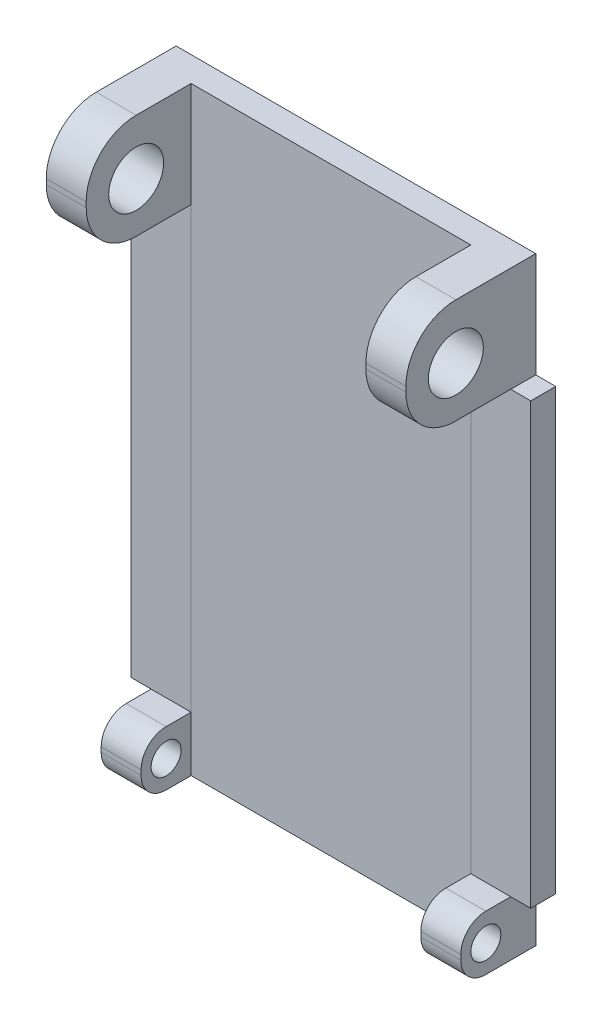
ISO-10303-21;
HEADER;
FILE_DESCRIPTION(('STEP AP214'),'2;1');
FILE_NAME('part.step','',(''),(''),'','','');
FILE_SCHEMA(('AUTOMOTIVE_DESIGN { 1 0 10303 214 1 1 1 1 }'));
ENDSEC;
DATA;
#1=APPLICATION_CONTEXT('core data for automotive mechanical design processes');
#2=APPLICATION_PROTOCOL_DEFINITION('international standard','automotive_design',2000,#1);
#3=PRODUCT_CONTEXT('',#1,'mechanical');
#4=PRODUCT('Part','Part','',(#3));
#5=PRODUCT_RELATED_PRODUCT_CATEGORY('part','',(#4));
#6=PRODUCT_DEFINITION_FORMATION('','',#4);
#7=PRODUCT_DEFINITION_CONTEXT('part definition',#1,'design');
#8=PRODUCT_DEFINITION('design','',#6,#7);
#9=PRODUCT_DEFINITION_SHAPE('','',#8);
#10=(LENGTH_UNIT() NAMED_UNIT(*) SI_UNIT(.MILLI.,.METRE.));
#11=(NAMED_UNIT(*) PLANE_ANGLE_UNIT() SI_UNIT($,.RADIAN.));
#12=(NAMED_UNIT(*) SI_UNIT($,.STERADIAN.) SOLID_ANGLE_UNIT());
#13=UNCERTAINTY_MEASURE_WITH_UNIT(LENGTH_MEASURE(1.E-05),#10,'distance_accuracy_value','');
#14=(GEOMETRIC_REPRESENTATION_CONTEXT(3) GLOBAL_UNCERTAINTY_ASSIGNED_CONTEXT((#13)) GLOBAL_UNIT_ASSIGNED_CONTEXT((#10,
#11,#12)) REPRESENTATION_CONTEXT('',''));
#15=CARTESIAN_POINT('',(0.,0.,0.));
#16=DIRECTION('',(0.,0.,1.));
#17=DIRECTION('',(1.,0.,0.));
#18=AXIS2_PLACEMENT_3D('',#15,#16,#17);
#19=CARTESIAN_POINT('',(-20.,-30.,13.));
#20=DIRECTION('',(1.,0.,0.));
#21=DIRECTION('',(0.,0.,-1.));
#22=AXIS2_PLACEMENT_3D('',#19,#20,#21);
#23=PLANE('',#22);
#24=DIRECTION('',(0.,0.,-1.));
#25=VECTOR('',#24,1.);
#26=CARTESIAN_POINT('',(-20.,-24.5,0.));
#27=LINE('',#26,#25);
#28=CARTESIAN_POINT('',(-20.,-24.5,2.50299537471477));
#29=VERTEX_POINT('',#28);
#30=CARTESIAN_POINT('',(-20.,-24.5,0.));
#31=VERTEX_POINT('',#30);
#32=EDGE_CURVE('E1002',#29,#31,#27,.T.);
#33=ORIENTED_EDGE('',*,*,#32,.F.);
#34=DIRECTION('',(0.,1.,0.));
#35=VECTOR('',#34,1.);
#36=CARTESIAN_POINT('',(-20.,-24.5,2.50299537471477));
#37=LINE('',#36,#35);
#38=CARTESIAN_POINT('',(-20.,19.49,2.50299537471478));
#39=VERTEX_POINT('',#38);
#40=EDGE_CURVE('E459',#29,#39,#37,.T.);
#41=ORIENTED_EDGE('',*,*,#40,.T.);
#42=DIRECTION('',(0.,0.,1.));
#43=VECTOR('',#42,1.);
#44=CARTESIAN_POINT('',(-20.,19.49,10.));
#45=LINE('',#44,#43);
#46=CARTESIAN_POINT('',(-20.,19.49,0.));
#47=VERTEX_POINT('',#46);
#48=EDGE_CURVE('E596',#47,#39,#45,.T.);
#49=ORIENTED_EDGE('',*,*,#48,.F.);
#50=DIRECTION('',(0.,-1.,0.));
#51=VECTOR('',#50,1.);
#52=CARTESIAN_POINT('',(-20.,-30.,0.));
#53=LINE('',#52,#51);
#54=EDGE_CURVE('E477',#47,#31,#53,.T.);
#55=ORIENTED_EDGE('',*,*,#54,.T.);
#56=EDGE_LOOP('',(#33,#41,#49,#55));
#57=FACE_BOUND('',#56,.T.);
#58=ADVANCED_FACE('F37',(#57),#23,.F.);
#59=CARTESIAN_POINT('',(0.,0.,13.));
#60=DIRECTION('',(0.,0.,1.));
#61=DIRECTION('',(1.,0.,0.));
#62=AXIS2_PLACEMENT_3D('',#59,#60,#61);
#63=PLANE('',#62);
#64=DIRECTION('',(0.,1.,0.));
#65=VECTOR('',#64,1.);
#66=CARTESIAN_POINT('',(18.,19.49,13.));
#67=LINE('',#66,#65);
#68=CARTESIAN_POINT('',(18.,24.49,13.));
#69=VERTEX_POINT('',#68);
#70=CARTESIAN_POINT('',(18.,25.,13.));
#71=VERTEX_POINT('',#70);
#72=EDGE_CURVE('E519',#69,#71,#67,.T.);
#73=ORIENTED_EDGE('',*,*,#72,.T.);
#74=DIRECTION('',(-1.,0.,0.));
#75=VECTOR('',#74,1.);
#76=CARTESIAN_POINT('',(14.,25.,13.));
#77=LINE('',#76,#75);
#78=CARTESIAN_POINT('',(14.,25.,13.));
#79=VERTEX_POINT('',#78);
#80=EDGE_CURVE('E313',#71,#79,#77,.T.);
#81=ORIENTED_EDGE('',*,*,#80,.T.);
#82=DIRECTION('',(0.,1.,0.));
#83=VECTOR('',#82,1.);
#84=CARTESIAN_POINT('',(14.,0.,13.));
#85=LINE('',#84,#83);
#86=CARTESIAN_POINT('',(14.,24.49,13.));
#87=VERTEX_POINT('',#86);
#88=EDGE_CURVE('E448',#87,#79,#85,.T.);
#89=ORIENTED_EDGE('',*,*,#88,.F.);
#90=DIRECTION('',(1.,0.,0.));
#91=VECTOR('',#90,1.);
#92=CARTESIAN_POINT('',(20.,24.49,13.));
#93=LINE('',#92,#91);
#94=EDGE_CURVE('E310',#87,#69,#93,.T.);
#95=ORIENTED_EDGE('',*,*,#94,.T.);
#96=EDGE_LOOP('',(#73,#81,#89,#95));
#97=FACE_BOUND('',#96,.T.);
#98=ADVANCED_FACE('F553',(#97),#63,.T.);
#99=CARTESIAN_POINT('',(-20.,19.49,13.));
#100=DIRECTION('',(0.,1.,0.));
#101=DIRECTION('',(0.,0.,1.));
#102=AXIS2_PLACEMENT_3D('',#99,#100,#101);
#103=PLANE('',#102);
#104=DIRECTION('',(1.,0.,0.));
#105=VECTOR('',#104,1.);
#106=CARTESIAN_POINT('',(-20.,19.49,7.50299537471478));
#107=LINE('',#106,#105);
#108=CARTESIAN_POINT('',(14.,19.49,7.50299537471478));
#109=VERTEX_POINT('',#108);
#110=CARTESIAN_POINT('',(18.,19.49,7.50299537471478));
#111=VERTEX_POINT('',#110);
#112=EDGE_CURVE('E466',#109,#111,#107,.T.);
#113=ORIENTED_EDGE('',*,*,#112,.T.);
#114=DIRECTION('',(0.,0.,1.));
#115=VECTOR('',#114,1.);
#116=CARTESIAN_POINT('',(18.,19.49,0.));
#117=LINE('',#116,#115);
#118=CARTESIAN_POINT('',(18.,19.49,8.));
#119=VERTEX_POINT('',#118);
#120=EDGE_CURVE('E515',#111,#119,#117,.T.);
#121=ORIENTED_EDGE('',*,*,#120,.T.);
#122=DIRECTION('',(1.,0.,0.));
#123=VECTOR('',#122,1.);
#124=CARTESIAN_POINT('',(14.,19.49,8.));
#125=LINE('',#124,#123);
#126=CARTESIAN_POINT('',(14.,19.49,8.));
#127=VERTEX_POINT('',#126);
#128=EDGE_CURVE('E323',#119,#127,#125,.F.);
#129=ORIENTED_EDGE('',*,*,#128,.T.);
#130=DIRECTION('',(0.,0.,-1.));
#131=VECTOR('',#130,1.);
#132=CARTESIAN_POINT('',(14.,19.49,13.));
#133=LINE('',#132,#131);
#134=EDGE_CURVE('E446',#127,#109,#133,.T.);
#135=ORIENTED_EDGE('',*,*,#134,.T.);
#136=EDGE_LOOP('',(#113,#121,#129,#135));
#137=FACE_BOUND('',#136,.T.);
#138=ADVANCED_FACE('F544',(#137),#103,.F.);
#139=CARTESIAN_POINT('',(-20.,-30.,7.50299537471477));
#140=DIRECTION('',(0.,0.,-1.));
#141=DIRECTION('',(0.,1.,0.));
#142=AXIS2_PLACEMENT_3D('',#139,#140,#141);
#143=PLANE('',#142);
#144=DIRECTION('',(1.,0.,0.));
#145=VECTOR('',#144,1.);
#146=CARTESIAN_POINT('',(-20.,-27.5,7.50299537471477));
#147=LINE('',#146,#145);
#148=CARTESIAN_POINT('',(14.,-27.5,7.50299537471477));
#149=VERTEX_POINT('',#148);
#150=CARTESIAN_POINT('',(18.,-27.5,7.50299537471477));
#151=VERTEX_POINT('',#150);
#152=EDGE_CURVE('E339',#149,#151,#147,.T.);
#153=ORIENTED_EDGE('',*,*,#152,.T.);
#154=DIRECTION('',(0.,1.,0.));
#155=VECTOR('',#154,1.);
#156=CARTESIAN_POINT('',(18.,-30.,7.50299537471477));
#157=LINE('',#156,#155);
#158=CARTESIAN_POINT('',(18.,-27.,7.50299537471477));
#159=VERTEX_POINT('',#158);
#160=EDGE_CURVE('E350',#151,#159,#157,.T.);
#161=ORIENTED_EDGE('',*,*,#160,.T.);
#162=DIRECTION('',(1.,0.,0.));
#163=VECTOR('',#162,1.);
#164=CARTESIAN_POINT('',(-20.,-27.,7.50299537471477));
#165=LINE('',#164,#163);
#166=CARTESIAN_POINT('',(14.,-27.,7.50299537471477));
#167=VERTEX_POINT('',#166);
#168=EDGE_CURVE('E337',#159,#167,#165,.F.);
#169=ORIENTED_EDGE('',*,*,#168,.T.);
#170=DIRECTION('',(0.,-1.,0.));
#171=VECTOR('',#170,1.);
#172=CARTESIAN_POINT('',(14.,-30.,7.50299537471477));
#173=LINE('',#172,#171);
#174=EDGE_CURVE('E370',#167,#149,#173,.T.);
#175=ORIENTED_EDGE('',*,*,#174,.T.);
#176=EDGE_LOOP('',(#153,#161,#169,#175));
#177=FACE_BOUND('',#176,.T.);
#178=ADVANCED_FACE('F356',(#177),#143,.F.);
#179=CARTESIAN_POINT('',(-20.,-27.27,5.));
#180=DIRECTION('',(1.,0.,0.));
#181=DIRECTION('',(0.,0.,-1.));
#182=AXIS2_PLACEMENT_3D('',#179,#180,#181);
#183=CYLINDRICAL_SURFACE('',#182,1.5);
#184=CARTESIAN_POINT('',(18.,-27.27,5.));
#185=DIRECTION('',(-1.,0.,0.));
#186=DIRECTION('',(0.,-1.,0.));
#187=AXIS2_PLACEMENT_3D('',#184,#185,#186);
#188=CIRCLE('',#187,1.5);
#189=CARTESIAN_POINT('',(18.,-28.77,5.));
#190=VERTEX_POINT('',#189);
#191=EDGE_CURVE('E593',#190,#190,#188,.F.);
#192=ORIENTED_EDGE('',*,*,#191,.T.);
#193=EDGE_LOOP('',(#192));
#194=FACE_BOUND('',#193,.T.);
#195=CARTESIAN_POINT('',(14.,-27.27,5.));
#196=DIRECTION('',(1.,0.,0.));
#197=DIRECTION('',(0.,0.,-1.));
#198=AXIS2_PLACEMENT_3D('',#195,#196,#197);
#199=CIRCLE('',#198,1.5);
#200=CARTESIAN_POINT('',(14.,-27.27,3.5));
#201=VERTEX_POINT('',#200);
#202=EDGE_CURVE('E452',#201,#201,#199,.F.);
#203=ORIENTED_EDGE('',*,*,#202,.T.);
#204=EDGE_LOOP('',(#203));
#205=FACE_BOUND('',#204,.T.);
#206=ADVANCED_FACE('F735',(#194,#205),#183,.F.);
#207=CARTESIAN_POINT('',(-20.,-24.5,7.50299537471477));
#208=DIRECTION('',(0.,0.,1.));
#209=DIRECTION('',(0.,-1.,0.));
#210=AXIS2_PLACEMENT_3D('',#207,#208,#209);
#211=PLANE('',#210);
#212=DIRECTION('',(1.,0.,0.));
#213=VECTOR('',#212,1.);
#214=CARTESIAN_POINT('',(-20.,19.5,7.50299537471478));
#215=LINE('',#214,#213);
#216=CARTESIAN_POINT('',(14.,19.5,7.50299537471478));
#217=VERTEX_POINT('',#216);
#218=CARTESIAN_POINT('',(18.,19.5,7.50299537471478));
#219=VERTEX_POINT('',#218);
#220=EDGE_CURVE('E467',#217,#219,#215,.T.);
#221=ORIENTED_EDGE('',*,*,#220,.T.);
#222=DIRECTION('',(0.,-1.,0.));
#223=VECTOR('',#222,1.);
#224=CARTESIAN_POINT('',(18.,-24.5,7.50299537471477));
#225=LINE('',#224,#223);
#226=EDGE_CURVE('E385',#219,#111,#225,.T.);
#227=ORIENTED_EDGE('',*,*,#226,.T.);
#228=ORIENTED_EDGE('',*,*,#112,.F.);
#229=DIRECTION('',(0.,1.,0.));
#230=VECTOR('',#229,1.);
#231=CARTESIAN_POINT('',(14.,-24.5,7.50299537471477));
#232=LINE('',#231,#230);
#233=EDGE_CURVE('E442',#109,#217,#232,.T.);
#234=ORIENTED_EDGE('',*,*,#233,.T.);
#235=EDGE_LOOP('',(#221,#227,#228,#234));
#236=FACE_BOUND('',#235,.T.);
#237=ADVANCED_FACE('F541',(#236),#211,.F.);
#238=CARTESIAN_POINT('',(-20.,19.5,7.50299537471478));
#239=DIRECTION('',(0.,1.,0.));
#240=DIRECTION('',(0.,0.,1.));
#241=AXIS2_PLACEMENT_3D('',#238,#239,#240);
#242=PLANE('',#241);
#243=DIRECTION('',(1.,0.,0.));
#244=VECTOR('',#243,1.);
#245=CARTESIAN_POINT('',(-20.,19.5,2.50299537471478));
#246=LINE('',#245,#244);
#247=CARTESIAN_POINT('',(14.,19.5,2.50299537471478));
#248=VERTEX_POINT('',#247);
#249=CARTESIAN_POINT('',(18.,19.5,2.50299537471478));
#250=VERTEX_POINT('',#249);
#251=EDGE_CURVE('E470',#248,#250,#246,.T.);
#252=ORIENTED_EDGE('',*,*,#251,.T.);
#253=DIRECTION('',(0.,0.,1.));
#254=VECTOR('',#253,1.);
#255=CARTESIAN_POINT('',(18.,19.5,7.50299537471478));
#256=LINE('',#255,#254);
#257=EDGE_CURVE('E392',#250,#219,#256,.T.);
#258=ORIENTED_EDGE('',*,*,#257,.T.);
#259=ORIENTED_EDGE('',*,*,#220,.F.);
#260=DIRECTION('',(0.,0.,-1.));
#261=VECTOR('',#260,1.);
#262=CARTESIAN_POINT('',(14.,19.5,7.50299537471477));
#263=LINE('',#262,#261);
#264=EDGE_CURVE('E439',#217,#248,#263,.T.);
#265=ORIENTED_EDGE('',*,*,#264,.T.);
#266=EDGE_LOOP('',(#252,#258,#259,#265));
#267=FACE_BOUND('',#266,.T.);
#268=ADVANCED_FACE('F537',(#267),#242,.F.);
#269=CARTESIAN_POINT('',(-20.,-24.5,2.50299537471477));
#270=DIRECTION('',(0.,0.,-1.));
#271=DIRECTION('',(0.,1.,0.));
#272=AXIS2_PLACEMENT_3D('',#269,#270,#271);
#273=PLANE('',#272);
#274=DIRECTION('',(-1.,0.,0.));
#275=VECTOR('',#274,1.);
#276=CARTESIAN_POINT('',(-20.0000000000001,19.4899999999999,2.50299537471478));
#277=LINE('',#276,#275);
#278=CARTESIAN_POINT('',(20.,19.49,2.50299537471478));
#279=VERTEX_POINT('',#278);
#280=CARTESIAN_POINT('',(18.,19.49,2.50299537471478));
#281=VERTEX_POINT('',#280);
#282=EDGE_CURVE('E522',#279,#281,#277,.T.);
#283=ORIENTED_EDGE('',*,*,#282,.T.);
#284=DIRECTION('',(0.,1.,0.));
#285=VECTOR('',#284,1.);
#286=CARTESIAN_POINT('',(18.,-24.5,2.50299537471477));
#287=LINE('',#286,#285);
#288=EDGE_CURVE('E399',#281,#250,#287,.T.);
#289=ORIENTED_EDGE('',*,*,#288,.T.);
#290=ORIENTED_EDGE('',*,*,#251,.F.);
#291=DIRECTION('',(0.,-1.,0.));
#292=VECTOR('',#291,1.);
#293=CARTESIAN_POINT('',(14.,-24.5,2.50299537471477));
#294=LINE('',#293,#292);
#295=CARTESIAN_POINT('',(14.,-24.5,2.50299537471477));
#296=VERTEX_POINT('',#295);
#297=EDGE_CURVE('E437',#248,#296,#294,.T.);
#298=ORIENTED_EDGE('',*,*,#297,.T.);
#299=DIRECTION('',(1.,0.,0.));
#300=VECTOR('',#299,1.);
#301=CARTESIAN_POINT('',(-20.,-24.5,2.50299537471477));
#302=LINE('',#301,#300);
#303=CARTESIAN_POINT('',(18.,-24.5,2.50299537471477));
#304=VERTEX_POINT('',#303);
#305=EDGE_CURVE('E375',#296,#304,#302,.T.);
#306=ORIENTED_EDGE('',*,*,#305,.T.);
#307=DIRECTION('',(1.,0.,0.));
#308=VECTOR('',#307,1.);
#309=CARTESIAN_POINT('',(-20.,-24.5,2.50299537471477));
#310=LINE('',#309,#308);
#311=CARTESIAN_POINT('',(20.,-24.5,2.50299537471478));
#312=VERTEX_POINT('',#311);
#313=EDGE_CURVE('E361',#304,#312,#310,.T.);
#314=ORIENTED_EDGE('',*,*,#313,.T.);
#315=DIRECTION('',(0.,1.,0.));
#316=VECTOR('',#315,1.);
#317=CARTESIAN_POINT('',(20.,-24.5,2.50299537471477));
#318=LINE('',#317,#316);
#319=EDGE_CURVE('E458',#312,#279,#318,.T.);
#320=ORIENTED_EDGE('',*,*,#319,.T.);
#321=EDGE_LOOP('',(#283,#289,#290,#298,#306,#314,#320));
#322=FACE_BOUND('',#321,.T.);
#323=ADVANCED_FACE('F534',(#322),#273,.F.);
#324=CARTESIAN_POINT('',(-20.,-24.5,7.50299537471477));
#325=DIRECTION('',(0.,-1.,0.));
#326=DIRECTION('',(0.,0.,-1.));
#327=AXIS2_PLACEMENT_3D('',#324,#325,#326);
#328=PLANE('',#327);
#329=DIRECTION('',(1.,0.,0.));
#330=VECTOR('',#329,1.);
#331=CARTESIAN_POINT('',(-20.,-24.5,5.00299537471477));
#332=LINE('',#331,#330);
#333=CARTESIAN_POINT('',(14.,-24.5,5.00299537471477));
#334=VERTEX_POINT('',#333);
#335=CARTESIAN_POINT('',(18.,-24.5,5.00299537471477));
#336=VERTEX_POINT('',#335);
#337=EDGE_CURVE('E342',#334,#336,#332,.T.);
#338=ORIENTED_EDGE('',*,*,#337,.T.);
#339=DIRECTION('',(0.,0.,-1.));
#340=VECTOR('',#339,1.);
#341=CARTESIAN_POINT('',(18.,-24.5,0.));
#342=LINE('',#341,#340);
#343=EDGE_CURVE('E59',#336,#304,#342,.T.);
#344=ORIENTED_EDGE('',*,*,#343,.T.);
#345=ORIENTED_EDGE('',*,*,#305,.F.);
#346=DIRECTION('',(0.,0.,1.));
#347=VECTOR('',#346,1.);
#348=CARTESIAN_POINT('',(14.,-24.5,7.50299537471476));
#349=LINE('',#348,#347);
#350=EDGE_CURVE('E294',#296,#334,#349,.T.);
#351=ORIENTED_EDGE('',*,*,#350,.T.);
#352=EDGE_LOOP('',(#338,#344,#345,#351));
#353=FACE_BOUND('',#352,.T.);
#354=ADVANCED_FACE('F373',(#353),#328,.F.);
#355=CARTESIAN_POINT('',(20.,-30.,13.));
#356=DIRECTION('',(0.,1.,0.));
#357=DIRECTION('',(-1.,0.,0.));
#358=AXIS2_PLACEMENT_3D('',#355,#356,#357);
#359=PLANE('',#358);
#360=DIRECTION('',(1.,0.,0.));
#361=VECTOR('',#360,1.);
#362=CARTESIAN_POINT('',(20.,-30.,5.00299537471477));
#363=LINE('',#362,#361);
#364=CARTESIAN_POINT('',(-14.,-30.,5.00299537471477));
#365=VERTEX_POINT('',#364);
#366=CARTESIAN_POINT('',(-18.,-30.,5.00299537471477));
#367=VERTEX_POINT('',#366);
#368=EDGE_CURVE('E334',#365,#367,#363,.F.);
#369=ORIENTED_EDGE('',*,*,#368,.T.);
#370=DIRECTION('',(0.,0.,1.));
#371=VECTOR('',#370,1.);
#372=CARTESIAN_POINT('',(-18.,-30.,0.));
#373=LINE('',#372,#371);
#374=CARTESIAN_POINT('',(-18.,-30.,0.));
#375=VERTEX_POINT('',#374);
#376=EDGE_CURVE('E51',#375,#367,#373,.T.);
#377=ORIENTED_EDGE('',*,*,#376,.F.);
#378=DIRECTION('',(1.,0.,0.));
#379=VECTOR('',#378,1.);
#380=CARTESIAN_POINT('',(20.,-30.,0.));
#381=LINE('',#380,#379);
#382=CARTESIAN_POINT('',(18.,-30.,0.));
#383=VERTEX_POINT('',#382);
#384=EDGE_CURVE('E480',#375,#383,#381,.T.);
#385=ORIENTED_EDGE('',*,*,#384,.T.);
#386=DIRECTION('',(0.,0.,-1.));
#387=VECTOR('',#386,1.);
#388=CARTESIAN_POINT('',(18.,-30.,0.));
#389=LINE('',#388,#387);
#390=CARTESIAN_POINT('',(18.,-30.,5.00299537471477));
#391=VERTEX_POINT('',#390);
#392=EDGE_CURVE('E582',#391,#383,#389,.T.);
#393=ORIENTED_EDGE('',*,*,#392,.F.);
#394=DIRECTION('',(1.,0.,0.));
#395=VECTOR('',#394,1.);
#396=CARTESIAN_POINT('',(20.,-30.,5.00299537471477));
#397=LINE('',#396,#395);
#398=CARTESIAN_POINT('',(14.,-30.,5.00299537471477));
#399=VERTEX_POINT('',#398);
#400=EDGE_CURVE('E332',#391,#399,#397,.F.);
#401=ORIENTED_EDGE('',*,*,#400,.T.);
#402=DIRECTION('',(0.,0.,-1.));
#403=VECTOR('',#402,1.);
#404=CARTESIAN_POINT('',(14.,-30.,13.));
#405=LINE('',#404,#403);
#406=CARTESIAN_POINT('',(14.,-30.,2.5));
#407=VERTEX_POINT('',#406);
#408=EDGE_CURVE('E450',#399,#407,#405,.T.);
#409=ORIENTED_EDGE('',*,*,#408,.T.);
#410=DIRECTION('',(-1.,0.,0.));
#411=VECTOR('',#410,1.);
#412=CARTESIAN_POINT('',(20.,-30.,2.5));
#413=LINE('',#412,#411);
#414=CARTESIAN_POINT('',(-14.,-30.,2.5));
#415=VERTEX_POINT('',#414);
#416=EDGE_CURVE('E455',#407,#415,#413,.T.);
#417=ORIENTED_EDGE('',*,*,#416,.T.);
#418=DIRECTION('',(0.,0.,1.));
#419=VECTOR('',#418,1.);
#420=CARTESIAN_POINT('',(-14.,-30.,13.));
#421=LINE('',#420,#419);
#422=EDGE_CURVE('E431',#415,#365,#421,.T.);
#423=ORIENTED_EDGE('',*,*,#422,.T.);
#424=EDGE_LOOP('',(#369,#377,#385,#393,#401,#409,#417,#423));
#425=FACE_BOUND('',#424,.T.);
#426=ADVANCED_FACE('F648',(#425),#359,.F.);
#427=CARTESIAN_POINT('',(20.,-30.,13.));
#428=DIRECTION('',(-1.,0.,0.));
#429=DIRECTION('',(0.,0.,1.));
#430=AXIS2_PLACEMENT_3D('',#427,#428,#429);
#431=PLANE('',#430);
#432=ORIENTED_EDGE('',*,*,#319,.F.);
#433=DIRECTION('',(0.,0.,1.));
#434=VECTOR('',#433,1.);
#435=CARTESIAN_POINT('',(20.,-24.5,0.));
#436=LINE('',#435,#434);
#437=CARTESIAN_POINT('',(20.,-24.5,0.));
#438=VERTEX_POINT('',#437);
#439=EDGE_CURVE('E576',#438,#312,#436,.T.);
#440=ORIENTED_EDGE('',*,*,#439,.F.);
#441=DIRECTION('',(0.,1.,0.));
#442=VECTOR('',#441,1.);
#443=CARTESIAN_POINT('',(20.,-30.,0.));
#444=LINE('',#443,#442);
#445=CARTESIAN_POINT('',(20.,19.49,0.));
#446=VERTEX_POINT('',#445);
#447=EDGE_CURVE('E482',#438,#446,#444,.T.);
#448=ORIENTED_EDGE('',*,*,#447,.T.);
#449=DIRECTION('',(0.,0.,-1.));
#450=VECTOR('',#449,1.);
#451=CARTESIAN_POINT('',(20.,19.49,0.));
#452=LINE('',#451,#450);
#453=EDGE_CURVE('E503',#279,#446,#452,.T.);
#454=ORIENTED_EDGE('',*,*,#453,.F.);
#455=EDGE_LOOP('',(#432,#440,#448,#454));
#456=FACE_BOUND('',#455,.T.);
#457=ADVANCED_FACE('F575',(#456),#431,.F.);
#458=CARTESIAN_POINT('',(20.,30.,13.));
#459=DIRECTION('',(0.,-1.,0.));
#460=DIRECTION('',(1.,0.,0.));
#461=AXIS2_PLACEMENT_3D('',#458,#459,#460);
#462=PLANE('',#461);
#463=DIRECTION('',(-1.,0.,0.));
#464=VECTOR('',#463,1.);
#465=CARTESIAN_POINT('',(20.,30.,0.));
#466=LINE('',#465,#464);
#467=CARTESIAN_POINT('',(18.,30.,0.));
#468=VERTEX_POINT('',#467);
#469=CARTESIAN_POINT('',(-18.,30.,0.));
#470=VERTEX_POINT('',#469);
#471=EDGE_CURVE('E379',#468,#470,#466,.T.);
#472=ORIENTED_EDGE('',*,*,#471,.T.);
#473=DIRECTION('',(0.,0.,-1.));
#474=VECTOR('',#473,1.);
#475=CARTESIAN_POINT('',(-18.,30.,9.99999999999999));
#476=LINE('',#475,#474);
#477=CARTESIAN_POINT('',(-18.,30.,8.));
#478=VERTEX_POINT('',#477);
#479=EDGE_CURVE('E488',#478,#470,#476,.T.);
#480=ORIENTED_EDGE('',*,*,#479,.F.);
#481=DIRECTION('',(-1.,0.,0.));
#482=VECTOR('',#481,1.);
#483=CARTESIAN_POINT('',(-14.,30.,8.));
#484=LINE('',#483,#482);
#485=CARTESIAN_POINT('',(-14.,30.,8.));
#486=VERTEX_POINT('',#485);
#487=EDGE_CURVE('E270',#478,#486,#484,.F.);
#488=ORIENTED_EDGE('',*,*,#487,.T.);
#489=DIRECTION('',(0.,0.,1.));
#490=VECTOR('',#489,1.);
#491=CARTESIAN_POINT('',(-14.,30.,13.2));
#492=LINE('',#491,#490);
#493=CARTESIAN_POINT('',(-14.,30.,2.5));
#494=VERTEX_POINT('',#493);
#495=EDGE_CURVE('E407',#494,#486,#492,.T.);
#496=ORIENTED_EDGE('',*,*,#495,.F.);
#497=DIRECTION('',(-1.,0.,0.));
#498=VECTOR('',#497,1.);
#499=CARTESIAN_POINT('',(-14.,30.,2.5));
#500=LINE('',#499,#498);
#501=CARTESIAN_POINT('',(14.,30.,2.5));
#502=VERTEX_POINT('',#501);
#503=EDGE_CURVE('E404',#502,#494,#500,.T.);
#504=ORIENTED_EDGE('',*,*,#503,.F.);
#505=DIRECTION('',(0.,0.,-1.));
#506=VECTOR('',#505,1.);
#507=CARTESIAN_POINT('',(14.,30.,2.5));
#508=LINE('',#507,#506);
#509=CARTESIAN_POINT('',(14.,30.,8.));
#510=VERTEX_POINT('',#509);
#511=EDGE_CURVE('E389',#510,#502,#508,.T.);
#512=ORIENTED_EDGE('',*,*,#511,.F.);
#513=DIRECTION('',(-1.,0.,0.));
#514=VECTOR('',#513,1.);
#515=CARTESIAN_POINT('',(20.,30.,8.));
#516=LINE('',#515,#514);
#517=CARTESIAN_POINT('',(18.,30.,8.));
#518=VERTEX_POINT('',#517);
#519=EDGE_CURVE('E289',#510,#518,#516,.F.);
#520=ORIENTED_EDGE('',*,*,#519,.T.);
#521=DIRECTION('',(0.,0.,1.));
#522=VECTOR('',#521,1.);
#523=CARTESIAN_POINT('',(18.,30.,0.));
#524=LINE('',#523,#522);
#525=EDGE_CURVE('E489',#468,#518,#524,.T.);
#526=ORIENTED_EDGE('',*,*,#525,.F.);
#527=EDGE_LOOP('',(#472,#480,#488,#496,#504,#512,#520,#526));
#528=FACE_BOUND('',#527,.T.);
#529=ADVANCED_FACE('F487',(#528),#462,.F.);
#530=DIRECTION('',(0.,-1.,0.));
#531=VECTOR('',#530,1.);
#532=CARTESIAN_POINT('',(-18.,19.9074243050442,13.));
#533=LINE('',#532,#531);
#534=CARTESIAN_POINT('',(-18.,25.,13.));
#535=VERTEX_POINT('',#534);
#536=CARTESIAN_POINT('',(-18.,24.49,13.));
#537=VERTEX_POINT('',#536);
#538=EDGE_CURVE('E277',#535,#537,#533,.T.);
#539=ORIENTED_EDGE('',*,*,#538,.T.);
#540=DIRECTION('',(1.,0.,0.));
#541=VECTOR('',#540,1.);
#542=CARTESIAN_POINT('',(-14.,24.49,13.));
#543=LINE('',#542,#541);
#544=CARTESIAN_POINT('',(-14.,24.49,13.));
#545=VERTEX_POINT('',#544);
#546=EDGE_CURVE('E290',#537,#545,#543,.T.);
#547=ORIENTED_EDGE('',*,*,#546,.T.);
#548=DIRECTION('',(0.,-1.,0.));
#549=VECTOR('',#548,1.);
#550=CARTESIAN_POINT('',(-14.,0.,13.));
#551=LINE('',#550,#549);
#552=CARTESIAN_POINT('',(-14.,25.,13.));
#553=VERTEX_POINT('',#552);
#554=EDGE_CURVE('E288',#553,#545,#551,.T.);
#555=ORIENTED_EDGE('',*,*,#554,.F.);
#556=DIRECTION('',(-1.,0.,0.));
#557=VECTOR('',#556,1.);
#558=CARTESIAN_POINT('',(-20.,25.,13.));
#559=LINE('',#558,#557);
#560=EDGE_CURVE('E269',#553,#535,#559,.T.);
#561=ORIENTED_EDGE('',*,*,#560,.T.);
#562=EDGE_LOOP('',(#539,#547,#555,#561));
#563=FACE_BOUND('',#562,.T.);
#564=ADVANCED_FACE('F286',(#563),#63,.T.);
#565=CARTESIAN_POINT('',(0.,0.,0.));
#566=DIRECTION('',(0.,0.,1.));
#567=DIRECTION('',(1.,0.,0.));
#568=AXIS2_PLACEMENT_3D('',#565,#566,#567);
#569=PLANE('',#568);
#570=ORIENTED_EDGE('',*,*,#384,.F.);
#571=DIRECTION('',(0.,-1.,0.));
#572=VECTOR('',#571,1.);
#573=CARTESIAN_POINT('',(-18.,-24.5,0.));
#574=LINE('',#573,#572);
#575=CARTESIAN_POINT('',(-18.,-24.5,0.));
#576=VERTEX_POINT('',#575);
#577=EDGE_CURVE('E651',#576,#375,#574,.T.);
#578=ORIENTED_EDGE('',*,*,#577,.F.);
#579=DIRECTION('',(1.,0.,0.));
#580=VECTOR('',#579,1.);
#581=CARTESIAN_POINT('',(-20.,-24.5,0.));
#582=LINE('',#581,#580);
#583=EDGE_CURVE('E1004',#31,#576,#582,.T.);
#584=ORIENTED_EDGE('',*,*,#583,.F.);
#585=ORIENTED_EDGE('',*,*,#54,.F.);
#586=DIRECTION('',(1.,0.,0.));
#587=VECTOR('',#586,1.);
#588=CARTESIAN_POINT('',(0.,19.49,0.));
#589=LINE('',#588,#587);
#590=CARTESIAN_POINT('',(-18.,19.49,0.));
#591=VERTEX_POINT('',#590);
#592=EDGE_CURVE('E274',#47,#591,#589,.T.);
#593=ORIENTED_EDGE('',*,*,#592,.T.);
#594=DIRECTION('',(0.,1.,0.));
#595=VECTOR('',#594,1.);
#596=CARTESIAN_POINT('',(-18.,0.,0.));
#597=LINE('',#596,#595);
#598=EDGE_CURVE('E498',#591,#470,#597,.T.);
#599=ORIENTED_EDGE('',*,*,#598,.T.);
#600=ORIENTED_EDGE('',*,*,#471,.F.);
#601=DIRECTION('',(0.,1.,0.));
#602=VECTOR('',#601,1.);
#603=CARTESIAN_POINT('',(18.,19.49,0.));
#604=LINE('',#603,#602);
#605=CARTESIAN_POINT('',(18.,19.49,0.));
#606=VERTEX_POINT('',#605);
#607=EDGE_CURVE('E496',#606,#468,#604,.T.);
#608=ORIENTED_EDGE('',*,*,#607,.F.);
#609=DIRECTION('',(-1.,0.,0.));
#610=VECTOR('',#609,1.);
#611=CARTESIAN_POINT('',(20.,19.49,0.));
#612=LINE('',#611,#610);
#613=EDGE_CURVE('E512',#446,#606,#612,.T.);
#614=ORIENTED_EDGE('',*,*,#613,.F.);
#615=ORIENTED_EDGE('',*,*,#447,.F.);
#616=DIRECTION('',(1.,0.,0.));
#617=VECTOR('',#616,1.);
#618=CARTESIAN_POINT('',(20.,-24.5,0.));
#619=LINE('',#618,#617);
#620=CARTESIAN_POINT('',(18.,-24.5,0.));
#621=VERTEX_POINT('',#620);
#622=EDGE_CURVE('E571',#621,#438,#619,.T.);
#623=ORIENTED_EDGE('',*,*,#622,.F.);
#624=DIRECTION('',(0.,-1.,0.));
#625=VECTOR('',#624,1.);
#626=CARTESIAN_POINT('',(18.,-24.5,0.));
#627=LINE('',#626,#625);
#628=EDGE_CURVE('E589',#621,#383,#627,.T.);
#629=ORIENTED_EDGE('',*,*,#628,.T.);
#630=EDGE_LOOP('',(#570,#578,#584,#585,#593,#599,#600,#608,#614,#615,#623,#629));
#631=FACE_BOUND('',#630,.T.);
#632=ADVANCED_FACE('F494',(#631),#569,.F.);
#633=DIRECTION('',(1.,0.,0.));
#634=VECTOR('',#633,1.);
#635=CARTESIAN_POINT('',(-20.,19.49,8.));
#636=LINE('',#635,#634);
#637=CARTESIAN_POINT('',(-14.,19.49,8.));
#638=VERTEX_POINT('',#637);
#639=CARTESIAN_POINT('',(-18.,19.49,8.));
#640=VERTEX_POINT('',#639);
#641=EDGE_CURVE('E307',#638,#640,#636,.F.);
#642=ORIENTED_EDGE('',*,*,#641,.T.);
#643=DIRECTION('',(0.,0.,-1.));
#644=VECTOR('',#643,1.);
#645=CARTESIAN_POINT('',(-18.,19.49,10.));
#646=LINE('',#645,#644);
#647=CARTESIAN_POINT('',(-18.,19.49,7.50299537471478));
#648=VERTEX_POINT('',#647);
#649=EDGE_CURVE('E600',#640,#648,#646,.T.);
#650=ORIENTED_EDGE('',*,*,#649,.T.);
#651=CARTESIAN_POINT('',(-14.,19.49,7.50299537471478));
#652=VERTEX_POINT('',#651);
#653=EDGE_CURVE('E475',#648,#652,#107,.T.);
#654=ORIENTED_EDGE('',*,*,#653,.T.);
#655=DIRECTION('',(0.,0.,1.));
#656=VECTOR('',#655,1.);
#657=CARTESIAN_POINT('',(-14.,19.49,13.));
#658=LINE('',#657,#656);
#659=EDGE_CURVE('E427',#652,#638,#658,.T.);
#660=ORIENTED_EDGE('',*,*,#659,.T.);
#661=EDGE_LOOP('',(#642,#650,#654,#660));
#662=FACE_BOUND('',#661,.T.);
#663=ADVANCED_FACE('F631',(#662),#103,.F.);
#664=DIRECTION('',(1.,0.,0.));
#665=VECTOR('',#664,1.);
#666=CARTESIAN_POINT('',(-20.,-27.,7.50299537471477));
#667=LINE('',#666,#665);
#668=CARTESIAN_POINT('',(-14.,-27.,7.50299537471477));
#669=VERTEX_POINT('',#668);
#670=CARTESIAN_POINT('',(-18.,-27.,7.50299537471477));
#671=VERTEX_POINT('',#670);
#672=EDGE_CURVE('E329',#669,#671,#667,.F.);
#673=ORIENTED_EDGE('',*,*,#672,.T.);
#674=DIRECTION('',(0.,-1.,0.));
#675=VECTOR('',#674,1.);
#676=CARTESIAN_POINT('',(-18.,-30.,7.50299537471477));
#677=LINE('',#676,#675);
#678=CARTESIAN_POINT('',(-18.,-27.5,7.50299537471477));
#679=VERTEX_POINT('',#678);
#680=EDGE_CURVE('E996',#671,#679,#677,.T.);
#681=ORIENTED_EDGE('',*,*,#680,.T.);
#682=DIRECTION('',(1.,0.,0.));
#683=VECTOR('',#682,1.);
#684=CARTESIAN_POINT('',(-20.,-27.5,7.50299537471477));
#685=LINE('',#684,#683);
#686=CARTESIAN_POINT('',(-14.,-27.5,7.50299537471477));
#687=VERTEX_POINT('',#686);
#688=EDGE_CURVE('E327',#679,#687,#685,.T.);
#689=ORIENTED_EDGE('',*,*,#688,.T.);
#690=DIRECTION('',(0.,1.,0.));
#691=VECTOR('',#690,1.);
#692=CARTESIAN_POINT('',(-14.,-30.,7.50299537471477));
#693=LINE('',#692,#691);
#694=EDGE_CURVE('E424',#687,#669,#693,.T.);
#695=ORIENTED_EDGE('',*,*,#694,.T.);
#696=EDGE_LOOP('',(#673,#681,#689,#695));
#697=FACE_BOUND('',#696,.T.);
#698=ADVANCED_FACE('F733',(#697),#143,.F.);
#699=CARTESIAN_POINT('',(-18.,-27.27,5.));
#700=DIRECTION('',(1.,0.,0.));
#701=DIRECTION('',(0.,1.,0.));
#702=AXIS2_PLACEMENT_3D('',#699,#700,#701);
#703=CIRCLE('',#702,1.5);
#704=CARTESIAN_POINT('',(-18.,-25.77,5.));
#705=VERTEX_POINT('',#704);
#706=EDGE_CURVE('E588',#705,#705,#703,.F.);
#707=ORIENTED_EDGE('',*,*,#706,.T.);
#708=EDGE_LOOP('',(#707));
#709=FACE_BOUND('',#708,.T.);
#710=CARTESIAN_POINT('',(-14.,-27.27,5.));
#711=DIRECTION('',(-1.,0.,0.));
#712=DIRECTION('',(0.,-1.,0.));
#713=AXIS2_PLACEMENT_3D('',#710,#711,#712);
#714=CIRCLE('',#713,1.5);
#715=CARTESIAN_POINT('',(-14.,-28.77,5.));
#716=VERTEX_POINT('',#715);
#717=EDGE_CURVE('E434',#716,#716,#714,.F.);
#718=ORIENTED_EDGE('',*,*,#717,.T.);
#719=EDGE_LOOP('',(#718));
#720=FACE_BOUND('',#719,.T.);
#721=ADVANCED_FACE('F730',(#709,#720),#183,.F.);
#722=ORIENTED_EDGE('',*,*,#653,.F.);
#723=DIRECTION('',(0.,1.,0.));
#724=VECTOR('',#723,1.);
#725=CARTESIAN_POINT('',(-18.,-24.5,7.50299537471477));
#726=LINE('',#725,#724);
#727=CARTESIAN_POINT('',(-18.,19.5,7.50299537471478));
#728=VERTEX_POINT('',#727);
#729=EDGE_CURVE('E501',#648,#728,#726,.T.);
#730=ORIENTED_EDGE('',*,*,#729,.T.);
#731=CARTESIAN_POINT('',(-14.,19.5,7.50299537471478));
#732=VERTEX_POINT('',#731);
#733=EDGE_CURVE('E464',#728,#732,#215,.T.);
#734=ORIENTED_EDGE('',*,*,#733,.T.);
#735=DIRECTION('',(0.,-1.,0.));
#736=VECTOR('',#735,1.);
#737=CARTESIAN_POINT('',(-14.,-24.5,7.50299537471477));
#738=LINE('',#737,#736);
#739=EDGE_CURVE('E421',#732,#652,#738,.T.);
#740=ORIENTED_EDGE('',*,*,#739,.T.);
#741=EDGE_LOOP('',(#722,#730,#734,#740));
#742=FACE_BOUND('',#741,.T.);
#743=ADVANCED_FACE('F628',(#742),#211,.F.);
#744=ORIENTED_EDGE('',*,*,#733,.F.);
#745=DIRECTION('',(0.,0.,-1.));
#746=VECTOR('',#745,1.);
#747=CARTESIAN_POINT('',(-18.,19.5,7.50299537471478));
#748=LINE('',#747,#746);
#749=CARTESIAN_POINT('',(-18.,19.5,2.50299537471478));
#750=VERTEX_POINT('',#749);
#751=EDGE_CURVE('E506',#728,#750,#748,.T.);
#752=ORIENTED_EDGE('',*,*,#751,.T.);
#753=CARTESIAN_POINT('',(-14.,19.5,2.50299537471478));
#754=VERTEX_POINT('',#753);
#755=EDGE_CURVE('E468',#750,#754,#246,.T.);
#756=ORIENTED_EDGE('',*,*,#755,.T.);
#757=DIRECTION('',(0.,0.,1.));
#758=VECTOR('',#757,1.);
#759=CARTESIAN_POINT('',(-14.,19.5,7.50299537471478));
#760=LINE('',#759,#758);
#761=EDGE_CURVE('E418',#754,#732,#760,.T.);
#762=ORIENTED_EDGE('',*,*,#761,.T.);
#763=EDGE_LOOP('',(#744,#752,#756,#762));
#764=FACE_BOUND('',#763,.T.);
#765=ADVANCED_FACE('F614',(#764),#242,.F.);
#766=ORIENTED_EDGE('',*,*,#755,.F.);
#767=DIRECTION('',(0.,-1.,0.));
#768=VECTOR('',#767,1.);
#769=CARTESIAN_POINT('',(-18.,-24.5,2.50299537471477));
#770=LINE('',#769,#768);
#771=CARTESIAN_POINT('',(-18.,19.49,2.50299537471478));
#772=VERTEX_POINT('',#771);
#773=EDGE_CURVE('E608',#750,#772,#770,.T.);
#774=ORIENTED_EDGE('',*,*,#773,.T.);
#775=DIRECTION('',(-1.,0.,0.));
#776=VECTOR('',#775,1.);
#777=CARTESIAN_POINT('',(-19.9999999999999,19.49,2.50299537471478));
#778=LINE('',#777,#776);
#779=EDGE_CURVE('E602',#772,#39,#778,.T.);
#780=ORIENTED_EDGE('',*,*,#779,.T.);
#781=ORIENTED_EDGE('',*,*,#40,.F.);
#782=CARTESIAN_POINT('',(-18.,-24.5,2.50299537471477));
#783=VERTEX_POINT('',#782);
#784=EDGE_CURVE('E471',#29,#783,#302,.T.);
#785=ORIENTED_EDGE('',*,*,#784,.T.);
#786=CARTESIAN_POINT('',(-14.,-24.5,2.50299537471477));
#787=VERTEX_POINT('',#786);
#788=EDGE_CURVE('E474',#783,#787,#302,.T.);
#789=ORIENTED_EDGE('',*,*,#788,.T.);
#790=DIRECTION('',(0.,1.,0.));
#791=VECTOR('',#790,1.);
#792=CARTESIAN_POINT('',(-14.,-24.5,2.50299537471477));
#793=LINE('',#792,#791);
#794=EDGE_CURVE('E413',#787,#754,#793,.T.);
#795=ORIENTED_EDGE('',*,*,#794,.T.);
#796=EDGE_LOOP('',(#766,#774,#780,#781,#785,#789,#795));
#797=FACE_BOUND('',#796,.T.);
#798=ADVANCED_FACE('F617',(#797),#273,.F.);
#799=ORIENTED_EDGE('',*,*,#788,.F.);
#800=DIRECTION('',(0.,0.,1.));
#801=VECTOR('',#800,1.);
#802=CARTESIAN_POINT('',(-18.,-24.5,0.));
#803=LINE('',#802,#801);
#804=CARTESIAN_POINT('',(-18.,-24.5,5.00299537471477));
#805=VERTEX_POINT('',#804);
#806=EDGE_CURVE('E1009',#783,#805,#803,.T.);
#807=ORIENTED_EDGE('',*,*,#806,.T.);
#808=DIRECTION('',(1.,0.,0.));
#809=VECTOR('',#808,1.);
#810=CARTESIAN_POINT('',(-20.,-24.5,5.00299537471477));
#811=LINE('',#810,#809);
#812=CARTESIAN_POINT('',(-14.,-24.5,5.00299537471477));
#813=VERTEX_POINT('',#812);
#814=EDGE_CURVE('E325',#805,#813,#811,.T.);
#815=ORIENTED_EDGE('',*,*,#814,.T.);
#816=DIRECTION('',(0.,0.,-1.));
#817=VECTOR('',#816,1.);
#818=CARTESIAN_POINT('',(-14.,-24.5,7.50299537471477));
#819=LINE('',#818,#817);
#820=EDGE_CURVE('E376',#813,#787,#819,.T.);
#821=ORIENTED_EDGE('',*,*,#820,.T.);
#822=EDGE_LOOP('',(#799,#807,#815,#821));
#823=FACE_BOUND('',#822,.T.);
#824=ADVANCED_FACE('F717',(#823),#328,.F.);
#825=CARTESIAN_POINT('',(-14.,-30.5,2.5));
#826=DIRECTION('',(0.,0.,-1.));
#827=DIRECTION('',(-1.,0.,0.));
#828=AXIS2_PLACEMENT_3D('',#825,#826,#827);
#829=PLANE('',#828);
#830=DIRECTION('',(0.,1.,0.));
#831=VECTOR('',#830,1.);
#832=CARTESIAN_POINT('',(14.,-30.5,2.5));
#833=LINE('',#832,#831);
#834=EDGE_CURVE('E410',#407,#502,#833,.T.);
#835=ORIENTED_EDGE('',*,*,#834,.T.);
#836=ORIENTED_EDGE('',*,*,#503,.T.);
#837=DIRECTION('',(0.,1.,0.));
#838=VECTOR('',#837,1.);
#839=CARTESIAN_POINT('',(-14.,-30.5,2.5));
#840=LINE('',#839,#838);
#841=EDGE_CURVE('E411',#415,#494,#840,.T.);
#842=ORIENTED_EDGE('',*,*,#841,.F.);
#843=ORIENTED_EDGE('',*,*,#416,.F.);
#844=EDGE_LOOP('',(#835,#836,#842,#843));
#845=FACE_BOUND('',#844,.T.);
#846=ADVANCED_FACE('F639',(#845),#829,.F.);
#847=CARTESIAN_POINT('',(14.,-30.5,2.5));
#848=DIRECTION('',(1.,0.,0.));
#849=DIRECTION('',(0.,0.,-1.));
#850=AXIS2_PLACEMENT_3D('',#847,#848,#849);
#851=PLANE('',#850);
#852=CARTESIAN_POINT('',(14.,24.5,8.));
#853=DIRECTION('',(1.,0.,0.));
#854=DIRECTION('',(0.,0.,-1.));
#855=AXIS2_PLACEMENT_3D('',#852,#853,#854);
#856=CIRCLE('',#855,2.75);
#857=CARTESIAN_POINT('',(14.,24.5,5.25));
#858=VERTEX_POINT('',#857);
#859=EDGE_CURVE('E384',#858,#858,#856,.T.);
#860=ORIENTED_EDGE('',*,*,#859,.T.);
#861=EDGE_LOOP('',(#860));
#862=FACE_BOUND('',#861,.T.);
#863=ORIENTED_EDGE('',*,*,#88,.T.);
#864=CARTESIAN_POINT('',(14.,25.,8.));
#865=DIRECTION('',(1.,0.,0.));
#866=DIRECTION('',(0.,0.,-1.));
#867=AXIS2_PLACEMENT_3D('',#864,#865,#866);
#868=CIRCLE('',#867,5.);
#869=EDGE_CURVE('E321',#79,#510,#868,.F.);
#870=ORIENTED_EDGE('',*,*,#869,.T.);
#871=ORIENTED_EDGE('',*,*,#511,.T.);
#872=ORIENTED_EDGE('',*,*,#834,.F.);
#873=ORIENTED_EDGE('',*,*,#408,.F.);
#874=CARTESIAN_POINT('',(14.,-27.5,5.00299537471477));
#875=DIRECTION('',(1.,0.,0.));
#876=DIRECTION('',(0.,0.,-1.));
#877=AXIS2_PLACEMENT_3D('',#874,#875,#876);
#878=CIRCLE('',#877,2.5);
#879=EDGE_CURVE('E317',#399,#149,#878,.F.);
#880=ORIENTED_EDGE('',*,*,#879,.T.);
#881=ORIENTED_EDGE('',*,*,#174,.F.);
#882=CARTESIAN_POINT('',(14.,-27.,5.00299537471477));
#883=DIRECTION('',(1.,0.,0.));
#884=DIRECTION('',(0.,0.,-1.));
#885=AXIS2_PLACEMENT_3D('',#882,#883,#884);
#886=CIRCLE('',#885,2.5);
#887=EDGE_CURVE('E315',#167,#334,#886,.F.);
#888=ORIENTED_EDGE('',*,*,#887,.T.);
#889=ORIENTED_EDGE('',*,*,#350,.F.);
#890=ORIENTED_EDGE('',*,*,#297,.F.);
#891=ORIENTED_EDGE('',*,*,#264,.F.);
#892=ORIENTED_EDGE('',*,*,#233,.F.);
#893=ORIENTED_EDGE('',*,*,#134,.F.);
#894=CARTESIAN_POINT('',(14.,24.49,8.));
#895=DIRECTION('',(1.,0.,0.));
#896=DIRECTION('',(0.,0.,-1.));
#897=AXIS2_PLACEMENT_3D('',#894,#895,#896);
#898=CIRCLE('',#897,5.);
#899=EDGE_CURVE('E319',#127,#87,#898,.F.);
#900=ORIENTED_EDGE('',*,*,#899,.T.);
#901=EDGE_LOOP('',(#863,#870,#871,#872,#873,#880,#881,#888,#889,#890,#891,#892,#893,#900));
#902=FACE_BOUND('',#901,.T.);
#903=ORIENTED_EDGE('',*,*,#202,.F.);
#904=EDGE_LOOP('',(#903));
#905=FACE_BOUND('',#904,.T.);
#906=ADVANCED_FACE('F367',(#862,#902,#905),#851,.F.);
#907=CARTESIAN_POINT('',(-14.,-30.5,13.2));
#908=DIRECTION('',(-1.,0.,0.));
#909=DIRECTION('',(0.,-1.,0.));
#910=AXIS2_PLACEMENT_3D('',#907,#908,#909);
#911=PLANE('',#910);
#912=CARTESIAN_POINT('',(-14.,24.5,8.));
#913=DIRECTION('',(-1.,0.,0.));
#914=DIRECTION('',(0.,-1.,0.));
#915=AXIS2_PLACEMENT_3D('',#912,#913,#914);
#916=CIRCLE('',#915,2.75);
#917=CARTESIAN_POINT('',(-14.,21.75,8.));
#918=VERTEX_POINT('',#917);
#919=EDGE_CURVE('E382',#918,#918,#916,.T.);
#920=ORIENTED_EDGE('',*,*,#919,.T.);
#921=EDGE_LOOP('',(#920));
#922=FACE_BOUND('',#921,.T.);
#923=ORIENTED_EDGE('',*,*,#495,.T.);
#924=CARTESIAN_POINT('',(-14.,25.,8.));
#925=DIRECTION('',(-1.,0.,0.));
#926=DIRECTION('',(0.,-1.,0.));
#927=AXIS2_PLACEMENT_3D('',#924,#925,#926);
#928=CIRCLE('',#927,5.);
#929=EDGE_CURVE('E305',#486,#553,#928,.F.);
#930=ORIENTED_EDGE('',*,*,#929,.T.);
#931=ORIENTED_EDGE('',*,*,#554,.T.);
#932=CARTESIAN_POINT('',(-14.,24.49,8.));
#933=DIRECTION('',(-1.,0.,0.));
#934=DIRECTION('',(0.,-1.,0.));
#935=AXIS2_PLACEMENT_3D('',#932,#933,#934);
#936=CIRCLE('',#935,5.);
#937=EDGE_CURVE('E303',#545,#638,#936,.F.);
#938=ORIENTED_EDGE('',*,*,#937,.T.);
#939=ORIENTED_EDGE('',*,*,#659,.F.);
#940=ORIENTED_EDGE('',*,*,#739,.F.);
#941=ORIENTED_EDGE('',*,*,#761,.F.);
#942=ORIENTED_EDGE('',*,*,#794,.F.);
#943=ORIENTED_EDGE('',*,*,#820,.F.);
#944=CARTESIAN_POINT('',(-14.,-27.,5.00299537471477));
#945=DIRECTION('',(-1.,0.,0.));
#946=DIRECTION('',(0.,-1.,0.));
#947=AXIS2_PLACEMENT_3D('',#944,#945,#946);
#948=CIRCLE('',#947,2.5);
#949=EDGE_CURVE('E301',#813,#669,#948,.F.);
#950=ORIENTED_EDGE('',*,*,#949,.T.);
#951=ORIENTED_EDGE('',*,*,#694,.F.);
#952=CARTESIAN_POINT('',(-14.,-27.5,5.00299537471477));
#953=DIRECTION('',(-1.,0.,0.));
#954=DIRECTION('',(0.,-1.,0.));
#955=AXIS2_PLACEMENT_3D('',#952,#953,#954);
#956=CIRCLE('',#955,2.5);
#957=EDGE_CURVE('E299',#687,#365,#956,.F.);
#958=ORIENTED_EDGE('',*,*,#957,.T.);
#959=ORIENTED_EDGE('',*,*,#422,.F.);
#960=ORIENTED_EDGE('',*,*,#841,.T.);
#961=EDGE_LOOP('',(#923,#930,#931,#938,#939,#940,#941,#942,#943,#950,#951,#958,#959,#960));
#962=FACE_BOUND('',#961,.T.);
#963=ORIENTED_EDGE('',*,*,#717,.F.);
#964=EDGE_LOOP('',(#963));
#965=FACE_BOUND('',#964,.T.);
#966=ADVANCED_FACE('F622',(#922,#962,#965),#911,.F.);
#967=CARTESIAN_POINT('',(-20.,24.5,8.));
#968=DIRECTION('',(1.,0.,0.));
#969=DIRECTION('',(0.,0.,-1.));
#970=AXIS2_PLACEMENT_3D('',#967,#968,#969);
#971=CYLINDRICAL_SURFACE('',#970,2.75);
#972=CARTESIAN_POINT('',(-18.,24.5,8.));
#973=DIRECTION('',(1.,0.,0.));
#974=DIRECTION('',(0.,1.,0.));
#975=AXIS2_PLACEMENT_3D('',#972,#973,#974);
#976=CIRCLE('',#975,2.75);
#977=CARTESIAN_POINT('',(-18.,27.25,8.));
#978=VERTEX_POINT('',#977);
#979=EDGE_CURVE('E273',#978,#978,#976,.F.);
#980=ORIENTED_EDGE('',*,*,#979,.T.);
#981=EDGE_LOOP('',(#980));
#982=FACE_BOUND('',#981,.T.);
#983=ORIENTED_EDGE('',*,*,#919,.F.);
#984=EDGE_LOOP('',(#983));
#985=FACE_BOUND('',#984,.T.);
#986=ADVANCED_FACE('F711',(#982,#985),#971,.F.);
#987=CARTESIAN_POINT('',(18.,24.5,8.));
#988=DIRECTION('',(-1.,0.,0.));
#989=DIRECTION('',(0.,-1.,0.));
#990=AXIS2_PLACEMENT_3D('',#987,#988,#989);
#991=CIRCLE('',#990,2.75);
#992=CARTESIAN_POINT('',(18.,21.75,8.));
#993=VERTEX_POINT('',#992);
#994=EDGE_CURVE('E528',#993,#993,#991,.F.);
#995=ORIENTED_EDGE('',*,*,#994,.T.);
#996=EDGE_LOOP('',(#995));
#997=FACE_BOUND('',#996,.T.);
#998=ORIENTED_EDGE('',*,*,#859,.F.);
#999=EDGE_LOOP('',(#998));
#1000=FACE_BOUND('',#999,.T.);
#1001=ADVANCED_FACE('F679',(#997,#1000),#971,.F.);
#1002=CARTESIAN_POINT('',(0.,25.,8.));
#1003=DIRECTION('',(1.,0.,0.));
#1004=DIRECTION('',(0.,1.,0.));
#1005=AXIS2_PLACEMENT_3D('',#1002,#1003,#1004);
#1006=CYLINDRICAL_SURFACE('',#1005,5.);
#1007=CARTESIAN_POINT('',(-18.,25.,8.));
#1008=DIRECTION('',(1.,0.,0.));
#1009=DIRECTION('',(0.,1.,0.));
#1010=AXIS2_PLACEMENT_3D('',#1007,#1008,#1009);
#1011=CIRCLE('',#1010,5.);
#1012=EDGE_CURVE('E264',#535,#478,#1011,.F.);
#1013=ORIENTED_EDGE('',*,*,#1012,.F.);
#1014=ORIENTED_EDGE('',*,*,#560,.F.);
#1015=ORIENTED_EDGE('',*,*,#929,.F.);
#1016=ORIENTED_EDGE('',*,*,#487,.F.);
#1017=EDGE_LOOP('',(#1013,#1014,#1015,#1016));
#1018=FACE_BOUND('',#1017,.T.);
#1019=ADVANCED_FACE('F266',(#1018),#1006,.T.);
#1020=CARTESIAN_POINT('',(0.,24.49,8.));
#1021=DIRECTION('',(-1.,0.,0.));
#1022=DIRECTION('',(0.,0.,1.));
#1023=AXIS2_PLACEMENT_3D('',#1020,#1021,#1022);
#1024=CYLINDRICAL_SURFACE('',#1023,5.);
#1025=ORIENTED_EDGE('',*,*,#546,.F.);
#1026=CARTESIAN_POINT('',(-18.,24.49,8.));
#1027=DIRECTION('',(1.,0.,0.));
#1028=DIRECTION('',(0.,1.,0.));
#1029=AXIS2_PLACEMENT_3D('',#1026,#1027,#1028);
#1030=CIRCLE('',#1029,5.);
#1031=EDGE_CURVE('E281',#640,#537,#1030,.F.);
#1032=ORIENTED_EDGE('',*,*,#1031,.F.);
#1033=ORIENTED_EDGE('',*,*,#641,.F.);
#1034=ORIENTED_EDGE('',*,*,#937,.F.);
#1035=EDGE_LOOP('',(#1025,#1032,#1033,#1034));
#1036=FACE_BOUND('',#1035,.T.);
#1037=ADVANCED_FACE('F635',(#1036),#1024,.T.);
#1038=CARTESIAN_POINT('',(0.,25.,8.));
#1039=DIRECTION('',(1.,0.,0.));
#1040=DIRECTION('',(0.,1.,0.));
#1041=AXIS2_PLACEMENT_3D('',#1038,#1039,#1040);
#1042=CYLINDRICAL_SURFACE('',#1041,5.);
#1043=CARTESIAN_POINT('',(18.,25.,8.));
#1044=DIRECTION('',(-1.,0.,0.));
#1045=DIRECTION('',(0.,-1.,0.));
#1046=AXIS2_PLACEMENT_3D('',#1043,#1044,#1045);
#1047=CIRCLE('',#1046,5.);
#1048=EDGE_CURVE('E526',#518,#71,#1047,.F.);
#1049=ORIENTED_EDGE('',*,*,#1048,.F.);
#1050=ORIENTED_EDGE('',*,*,#519,.F.);
#1051=ORIENTED_EDGE('',*,*,#869,.F.);
#1052=ORIENTED_EDGE('',*,*,#80,.F.);
#1053=EDGE_LOOP('',(#1049,#1050,#1051,#1052));
#1054=FACE_BOUND('',#1053,.T.);
#1055=ADVANCED_FACE('F563',(#1054),#1042,.T.);
#1056=CARTESIAN_POINT('',(0.,24.49,8.));
#1057=DIRECTION('',(-1.,0.,0.));
#1058=DIRECTION('',(0.,0.,1.));
#1059=AXIS2_PLACEMENT_3D('',#1056,#1057,#1058);
#1060=CYLINDRICAL_SURFACE('',#1059,5.);
#1061=CARTESIAN_POINT('',(18.,24.49,8.));
#1062=DIRECTION('',(-1.,0.,0.));
#1063=DIRECTION('',(0.,-1.,0.));
#1064=AXIS2_PLACEMENT_3D('',#1061,#1062,#1063);
#1065=CIRCLE('',#1064,5.);
#1066=EDGE_CURVE('E345',#69,#119,#1065,.F.);
#1067=ORIENTED_EDGE('',*,*,#1066,.F.);
#1068=ORIENTED_EDGE('',*,*,#94,.F.);
#1069=ORIENTED_EDGE('',*,*,#899,.F.);
#1070=ORIENTED_EDGE('',*,*,#128,.F.);
#1071=EDGE_LOOP('',(#1067,#1068,#1069,#1070));
#1072=FACE_BOUND('',#1071,.T.);
#1073=ADVANCED_FACE('F551',(#1072),#1060,.T.);
#1074=CARTESIAN_POINT('',(-20.,-27.,5.00299537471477));
#1075=DIRECTION('',(1.,0.,0.));
#1076=DIRECTION('',(0.,0.,-1.));
#1077=AXIS2_PLACEMENT_3D('',#1074,#1075,#1076);
#1078=CYLINDRICAL_SURFACE('',#1077,2.5);
#1079=CARTESIAN_POINT('',(-18.,-27.,5.00299537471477));
#1080=DIRECTION('',(1.,0.,0.));
#1081=DIRECTION('',(0.,1.,0.));
#1082=AXIS2_PLACEMENT_3D('',#1079,#1080,#1081);
#1083=CIRCLE('',#1082,2.5);
#1084=EDGE_CURVE('E992',#671,#805,#1083,.F.);
#1085=ORIENTED_EDGE('',*,*,#1084,.F.);
#1086=ORIENTED_EDGE('',*,*,#672,.F.);
#1087=ORIENTED_EDGE('',*,*,#949,.F.);
#1088=ORIENTED_EDGE('',*,*,#814,.F.);
#1089=EDGE_LOOP('',(#1085,#1086,#1087,#1088));
#1090=FACE_BOUND('',#1089,.T.);
#1091=ADVANCED_FACE('F686',(#1090),#1078,.T.);
#1092=CARTESIAN_POINT('',(-20.,-27.5,5.00299537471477));
#1093=DIRECTION('',(1.,0.,0.));
#1094=DIRECTION('',(0.,1.,0.));
#1095=AXIS2_PLACEMENT_3D('',#1092,#1093,#1094);
#1096=CYLINDRICAL_SURFACE('',#1095,2.5);
#1097=CARTESIAN_POINT('',(-18.,-27.5,5.00299537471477));
#1098=DIRECTION('',(1.,0.,0.));
#1099=DIRECTION('',(0.,1.,0.));
#1100=AXIS2_PLACEMENT_3D('',#1097,#1098,#1099);
#1101=CIRCLE('',#1100,2.5);
#1102=EDGE_CURVE('E12',#367,#679,#1101,.F.);
#1103=ORIENTED_EDGE('',*,*,#1102,.F.);
#1104=ORIENTED_EDGE('',*,*,#368,.F.);
#1105=ORIENTED_EDGE('',*,*,#957,.F.);
#1106=ORIENTED_EDGE('',*,*,#688,.F.);
#1107=EDGE_LOOP('',(#1103,#1104,#1105,#1106));
#1108=FACE_BOUND('',#1107,.T.);
#1109=ADVANCED_FACE('F689',(#1108),#1096,.T.);
#1110=CARTESIAN_POINT('',(-20.,-27.5,5.00299537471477));
#1111=DIRECTION('',(1.,0.,0.));
#1112=DIRECTION('',(0.,1.,0.));
#1113=AXIS2_PLACEMENT_3D('',#1110,#1111,#1112);
#1114=CYLINDRICAL_SURFACE('',#1113,2.5);
#1115=CARTESIAN_POINT('',(18.,-27.5,5.00299537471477));
#1116=DIRECTION('',(-1.,0.,0.));
#1117=DIRECTION('',(0.,-1.,0.));
#1118=AXIS2_PLACEMENT_3D('',#1115,#1116,#1117);
#1119=CIRCLE('',#1118,2.5);
#1120=EDGE_CURVE('E360',#151,#391,#1119,.F.);
#1121=ORIENTED_EDGE('',*,*,#1120,.F.);
#1122=ORIENTED_EDGE('',*,*,#152,.F.);
#1123=ORIENTED_EDGE('',*,*,#879,.F.);
#1124=ORIENTED_EDGE('',*,*,#400,.F.);
#1125=EDGE_LOOP('',(#1121,#1122,#1123,#1124));
#1126=FACE_BOUND('',#1125,.T.);
#1127=ADVANCED_FACE('F645',(#1126),#1114,.T.);
#1128=CARTESIAN_POINT('',(-20.,-27.,5.00299537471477));
#1129=DIRECTION('',(1.,0.,0.));
#1130=DIRECTION('',(0.,0.,-1.));
#1131=AXIS2_PLACEMENT_3D('',#1128,#1129,#1130);
#1132=CYLINDRICAL_SURFACE('',#1131,2.5);
#1133=CARTESIAN_POINT('',(18.,-27.,5.00299537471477));
#1134=DIRECTION('',(-1.,0.,0.));
#1135=DIRECTION('',(0.,-1.,0.));
#1136=AXIS2_PLACEMENT_3D('',#1133,#1134,#1135);
#1137=CIRCLE('',#1136,2.5);
#1138=EDGE_CURVE('E45',#336,#159,#1137,.F.);
#1139=ORIENTED_EDGE('',*,*,#1138,.F.);
#1140=ORIENTED_EDGE('',*,*,#337,.F.);
#1141=ORIENTED_EDGE('',*,*,#887,.F.);
#1142=ORIENTED_EDGE('',*,*,#168,.F.);
#1143=EDGE_LOOP('',(#1139,#1140,#1141,#1142));
#1144=FACE_BOUND('',#1143,.T.);
#1145=ADVANCED_FACE('F39',(#1144),#1132,.T.);
#1146=CARTESIAN_POINT('',(18.,19.49,0.));
#1147=DIRECTION('',(-1.,0.,0.));
#1148=DIRECTION('',(0.,-1.,0.));
#1149=AXIS2_PLACEMENT_3D('',#1146,#1147,#1148);
#1150=PLANE('',#1149);
#1151=ORIENTED_EDGE('',*,*,#994,.F.);
#1152=EDGE_LOOP('',(#1151));
#1153=FACE_BOUND('',#1152,.T.);
#1154=ORIENTED_EDGE('',*,*,#257,.F.);
#1155=ORIENTED_EDGE('',*,*,#288,.F.);
#1156=EDGE_CURVE('E516',#606,#281,#117,.T.);
#1157=ORIENTED_EDGE('',*,*,#1156,.F.);
#1158=ORIENTED_EDGE('',*,*,#607,.T.);
#1159=ORIENTED_EDGE('',*,*,#525,.T.);
#1160=ORIENTED_EDGE('',*,*,#1048,.T.);
#1161=ORIENTED_EDGE('',*,*,#72,.F.);
#1162=ORIENTED_EDGE('',*,*,#1066,.T.);
#1163=ORIENTED_EDGE('',*,*,#120,.F.);
#1164=ORIENTED_EDGE('',*,*,#226,.F.);
#1165=EDGE_LOOP('',(#1154,#1155,#1157,#1158,#1159,#1160,#1161,#1162,#1163,#1164));
#1166=FACE_BOUND('',#1165,.T.);
#1167=ADVANCED_FACE('F564',(#1153,#1166),#1150,.F.);
#1168=CARTESIAN_POINT('',(0.,19.49,0.));
#1169=DIRECTION('',(0.,-1.,0.));
#1170=DIRECTION('',(1.,0.,0.));
#1171=AXIS2_PLACEMENT_3D('',#1168,#1169,#1170);
#1172=PLANE('',#1171);
#1173=ORIENTED_EDGE('',*,*,#453,.T.);
#1174=ORIENTED_EDGE('',*,*,#613,.T.);
#1175=ORIENTED_EDGE('',*,*,#1156,.T.);
#1176=ORIENTED_EDGE('',*,*,#282,.F.);
#1177=EDGE_LOOP('',(#1173,#1174,#1175,#1176));
#1178=FACE_BOUND('',#1177,.T.);
#1179=ADVANCED_FACE('F566',(#1178),#1172,.F.);
#1180=CARTESIAN_POINT('',(-18.,19.49,10.));
#1181=DIRECTION('',(1.,0.,0.));
#1182=DIRECTION('',(0.,1.,0.));
#1183=AXIS2_PLACEMENT_3D('',#1180,#1181,#1182);
#1184=PLANE('',#1183);
#1185=ORIENTED_EDGE('',*,*,#979,.F.);
#1186=EDGE_LOOP('',(#1185));
#1187=FACE_BOUND('',#1186,.T.);
#1188=EDGE_CURVE('E598',#772,#591,#646,.T.);
#1189=ORIENTED_EDGE('',*,*,#1188,.F.);
#1190=ORIENTED_EDGE('',*,*,#773,.F.);
#1191=ORIENTED_EDGE('',*,*,#751,.F.);
#1192=ORIENTED_EDGE('',*,*,#729,.F.);
#1193=ORIENTED_EDGE('',*,*,#649,.F.);
#1194=ORIENTED_EDGE('',*,*,#1031,.T.);
#1195=ORIENTED_EDGE('',*,*,#538,.F.);
#1196=ORIENTED_EDGE('',*,*,#1012,.T.);
#1197=ORIENTED_EDGE('',*,*,#479,.T.);
#1198=ORIENTED_EDGE('',*,*,#598,.F.);
#1199=EDGE_LOOP('',(#1189,#1190,#1191,#1192,#1193,#1194,#1195,#1196,#1197,#1198));
#1200=FACE_BOUND('',#1199,.T.);
#1201=ADVANCED_FACE('F279',(#1187,#1200),#1184,.F.);
#1202=CARTESIAN_POINT('',(0.,19.49,10.));
#1203=DIRECTION('',(0.,-1.,0.));
#1204=DIRECTION('',(-1.,0.,0.));
#1205=AXIS2_PLACEMENT_3D('',#1202,#1203,#1204);
#1206=PLANE('',#1205);
#1207=ORIENTED_EDGE('',*,*,#48,.T.);
#1208=ORIENTED_EDGE('',*,*,#779,.F.);
#1209=ORIENTED_EDGE('',*,*,#1188,.T.);
#1210=ORIENTED_EDGE('',*,*,#592,.F.);
#1211=EDGE_LOOP('',(#1207,#1208,#1209,#1210));
#1212=FACE_BOUND('',#1211,.T.);
#1213=ADVANCED_FACE('F663',(#1212),#1206,.F.);
#1214=CARTESIAN_POINT('',(18.,-24.5,0.));
#1215=DIRECTION('',(-1.,0.,0.));
#1216=DIRECTION('',(0.,-1.,0.));
#1217=AXIS2_PLACEMENT_3D('',#1214,#1215,#1216);
#1218=PLANE('',#1217);
#1219=ORIENTED_EDGE('',*,*,#1120,.T.);
#1220=ORIENTED_EDGE('',*,*,#392,.T.);
#1221=ORIENTED_EDGE('',*,*,#628,.F.);
#1222=EDGE_CURVE('E579',#304,#621,#342,.T.);
#1223=ORIENTED_EDGE('',*,*,#1222,.F.);
#1224=ORIENTED_EDGE('',*,*,#343,.F.);
#1225=ORIENTED_EDGE('',*,*,#1138,.T.);
#1226=ORIENTED_EDGE('',*,*,#160,.F.);
#1227=EDGE_LOOP('',(#1219,#1220,#1221,#1223,#1224,#1225,#1226));
#1228=FACE_BOUND('',#1227,.T.);
#1229=ORIENTED_EDGE('',*,*,#191,.F.);
#1230=EDGE_LOOP('',(#1229));
#1231=FACE_BOUND('',#1230,.T.);
#1232=ADVANCED_FACE('F348',(#1228,#1231),#1218,.F.);
#1233=CARTESIAN_POINT('',(0.,-24.5,0.));
#1234=DIRECTION('',(0.,1.,0.));
#1235=DIRECTION('',(0.,0.,1.));
#1236=AXIS2_PLACEMENT_3D('',#1233,#1234,#1235);
#1237=PLANE('',#1236);
#1238=ORIENTED_EDGE('',*,*,#1222,.T.);
#1239=ORIENTED_EDGE('',*,*,#622,.T.);
#1240=ORIENTED_EDGE('',*,*,#439,.T.);
#1241=ORIENTED_EDGE('',*,*,#313,.F.);
#1242=EDGE_LOOP('',(#1238,#1239,#1240,#1241));
#1243=FACE_BOUND('',#1242,.T.);
#1244=ADVANCED_FACE('F652',(#1243),#1237,.F.);
#1245=CARTESIAN_POINT('',(0.,-24.5,0.));
#1246=DIRECTION('',(0.,-1.,0.));
#1247=DIRECTION('',(0.,0.,-1.));
#1248=AXIS2_PLACEMENT_3D('',#1245,#1246,#1247);
#1249=PLANE('',#1248);
#1250=ORIENTED_EDGE('',*,*,#784,.F.);
#1251=ORIENTED_EDGE('',*,*,#32,.T.);
#1252=ORIENTED_EDGE('',*,*,#583,.T.);
#1253=EDGE_CURVE('E1006',#576,#783,#803,.T.);
#1254=ORIENTED_EDGE('',*,*,#1253,.T.);
#1255=EDGE_LOOP('',(#1250,#1251,#1252,#1254));
#1256=FACE_BOUND('',#1255,.T.);
#1257=ADVANCED_FACE('F654',(#1256),#1249,.T.);
#1258=CARTESIAN_POINT('',(-18.,-24.5,0.));
#1259=DIRECTION('',(1.,0.,0.));
#1260=DIRECTION('',(0.,1.,0.));
#1261=AXIS2_PLACEMENT_3D('',#1258,#1259,#1260);
#1262=PLANE('',#1261);
#1263=ORIENTED_EDGE('',*,*,#1084,.T.);
#1264=ORIENTED_EDGE('',*,*,#806,.F.);
#1265=ORIENTED_EDGE('',*,*,#1253,.F.);
#1266=ORIENTED_EDGE('',*,*,#577,.T.);
#1267=ORIENTED_EDGE('',*,*,#376,.T.);
#1268=ORIENTED_EDGE('',*,*,#1102,.T.);
#1269=ORIENTED_EDGE('',*,*,#680,.F.);
#1270=EDGE_LOOP('',(#1263,#1264,#1265,#1266,#1267,#1268,#1269));
#1271=FACE_BOUND('',#1270,.T.);
#1272=ORIENTED_EDGE('',*,*,#706,.F.);
#1273=EDGE_LOOP('',(#1272));
#1274=FACE_BOUND('',#1273,.T.);
#1275=ADVANCED_FACE('F660',(#1271,#1274),#1262,.F.);
#1276=CLOSED_SHELL('',(#58,#98,#138,#178,#206,#237,#268,#323,#354,#426,#457,#529,#564,#632,#663,
#698,#721,#743,#765,#798,#824,#846,#906,#966,#986,#1001,#1019,#1037,#1055,#1073,#1091,#1109,
#1127,#1145,#1167,#1179,#1201,#1213,#1232,#1244,#1257,#1275));
#1277=MANIFOLD_SOLID_BREP('B2',#1276);
#1278=ADVANCED_BREP_SHAPE_REPRESENTATION('',(#18,#1277),#14);
#1279=SHAPE_DEFINITION_REPRESENTATION(#9,#1278);
ENDSEC;
END-ISO-10303-21;
